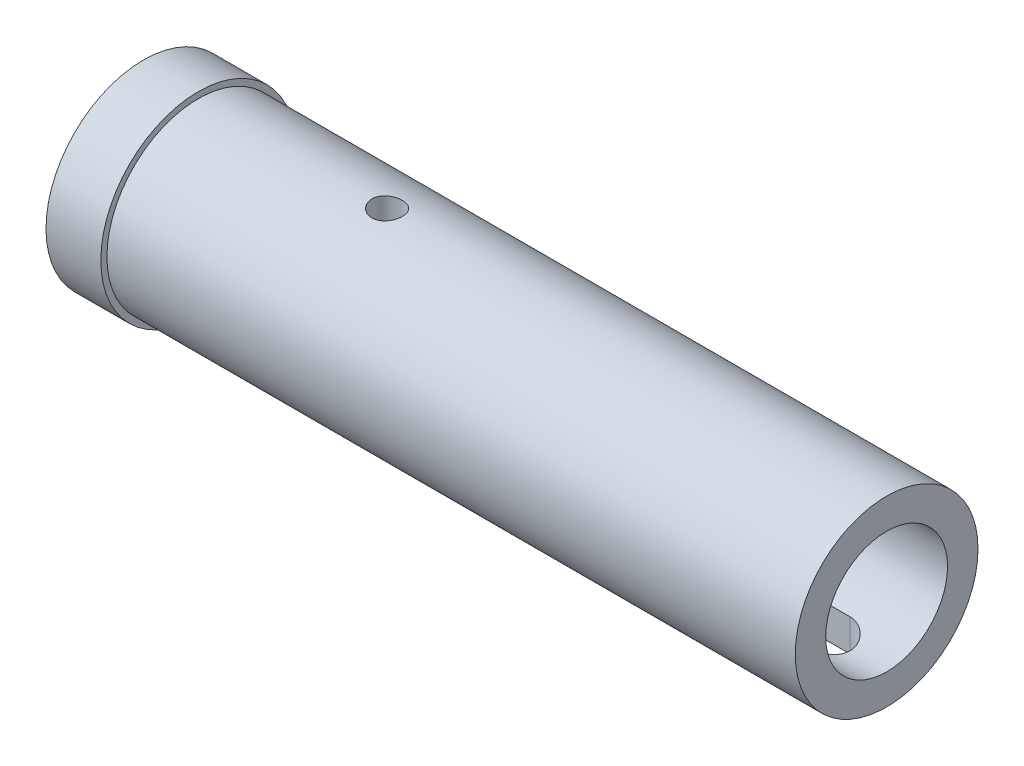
from build123d import *

# Parameters (mm, degrees)
CUT_EXTRUDE_1_DEPTH      = 10
CUT_EXTRUDE_2_REACH      = 126.081
SKETCH_3_R               = 10
HOLE_WIZARD_M3_1_D       = 2.5
HOLE_WIZARD_M3_1_DEPTH   = 7
HOLE_WIZARD_M3_1_TIP     = 0.751075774
SKETCH_6_R               = 11
CUT_EXTRUDE_3_DEPTH      = 12
CUT_EXTRUDE_4_REACH      = 77.472
CUT_EXTRUDE_4_END_RADIUS = 15
SKETCH_7_R               = 2.5


with BuildPart() as part:
    # Sketch 1 → Revolve 1 (revolve)
    with BuildSketch(Plane.XY, mode=Mode.PRIVATE) as revolve_1_sk:
        Polygon((50, 0), (-72, 0), (-72, 16), (-63, 16), (-63, 15), (50, 15), align=None)
    revolve(revolve_1_sk.sketch.rotate(Axis((50, 0, 0), (-1, 0, 0)), 90), axis=Axis((50, 0, 0), (-1, 0, 0)))

    # Sketch 2 → Cut-Extrude 1 (cut)
    with BuildSketch(Plane(origin=(0, -15, 0), x_dir=(-1, 0, 0), z_dir=(0, 1, 0))):
        with BuildLine():
            Line((-40, -4), (-3, -4))
            ThreePointArc((-3, -4), (1, 0), (-3, 4))
            Line((-3, 4), (-40, 4))
            ThreePointArc((-40, 4), (-44, 0), (-40, -4))
        make_face()
    extrude(amount=CUT_EXTRUDE_1_DEPTH, mode=Mode.SUBTRACT)

    # Sketch 3 → Cut-Extrude 2 (cut, up to next)
    with BuildSketch(Plane.ZY.offset(72), mode=Mode.PRIVATE) as cut_extrude_2_sk1:
        Circle(SKETCH_3_R)
    cut_extrude_2_tool1 = extrude(cut_extrude_2_sk1.sketch, amount=-CUT_EXTRUDE_2_REACH, mode=Mode.PRIVATE) & part.part
    add(cut_extrude_2_tool1.solids().sort_by_distance((-72, 0, 0))[0], mode=Mode.SUBTRACT)

    # Hole Wizard M3 _1
    with Locations(Plane(origin=(-72, 0, -14), x_dir=(0, 0, -1), z_dir=(-1, 0, 0))):
        with Locations((0, 0), (-14, -14), (-28, 0), (-14, 14)):
            Hole(HOLE_WIZARD_M3_1_D / 2, depth=HOLE_WIZARD_M3_1_DEPTH)
            with Locations((0, 0, -(HOLE_WIZARD_M3_1_DEPTH + HOLE_WIZARD_M3_1_TIP / 2))):  # 118° drill point
                Cone(0, HOLE_WIZARD_M3_1_D / 2, HOLE_WIZARD_M3_1_TIP, mode=Mode.SUBTRACT)

    # Sketch 6 → Cut-Extrude 3 (cut)
    with BuildSketch(Plane.ZY.offset(72)):
        Circle(SKETCH_6_R)
    extrude(amount=-CUT_EXTRUDE_3_DEPTH, mode=Mode.SUBTRACT)

    # Cut-Extrude 4: up to this cylinder (the profile starts inside it)
    cut_extrude_4_end = Plane(origin=(-32, 0, 0), z_dir=(1, 0, 0)) * Cylinder(CUT_EXTRUDE_4_END_RADIUS, 185.944, mode=Mode.PRIVATE)
    # Sketch 7 → Cut-Extrude 4 (cut, up to the surface)
    with BuildSketch(Plane(origin=(0, 0, 0), x_dir=(1, 0, 0), z_dir=(0, 1, 0)), mode=Mode.PRIVATE) as cut_extrude_4_sk1:
        with Locations(Location((-32, 0, 0), (0, 0, 90))):
            Circle(SKETCH_7_R)
    cut_extrude_4_tool1 = extrude(cut_extrude_4_sk1.sketch, amount=CUT_EXTRUDE_4_REACH, mode=Mode.PRIVATE) & cut_extrude_4_end
    add(cut_extrude_4_tool1.solids().sort_by_distance((-32, 0, 0))[0], mode=Mode.SUBTRACT)


solid = part.part
